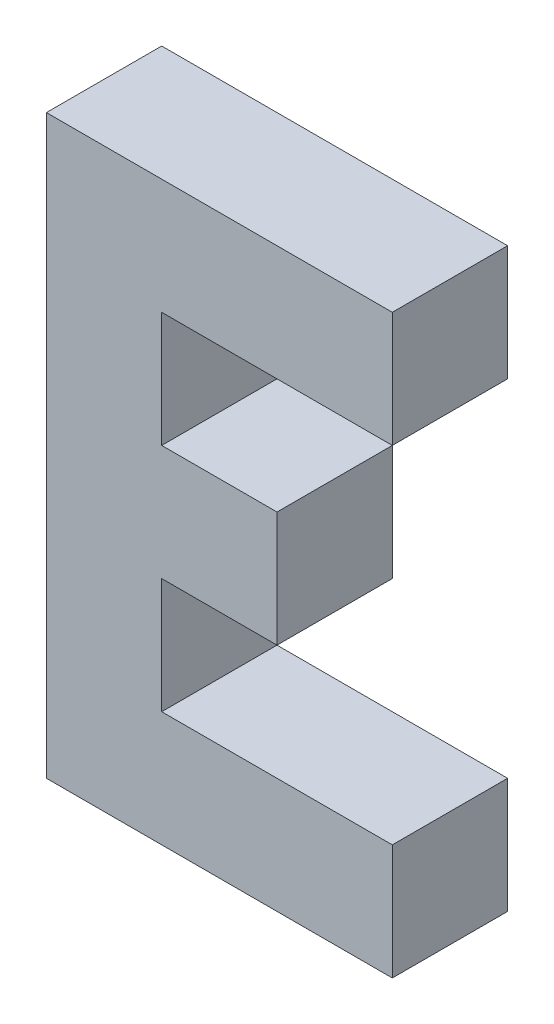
from build123d import *

# Parameters (mm, degrees)
BOSS_EXTRU_1_DEPTH = 10


with BuildPart() as part:
    # Esquisse1 → Boss.-Extru.1 (new body)
    with BuildSketch(Plane.XY):
        Polygon((30, 40), (30, 50), (0, 50), (0, 0), (30, 0), (30, 10), (10, 10), (10, 20), (20, 20), (20, 30), (10, 30), (10, 40), align=None)
    extrude(amount=BOSS_EXTRU_1_DEPTH)


solid = part.part
